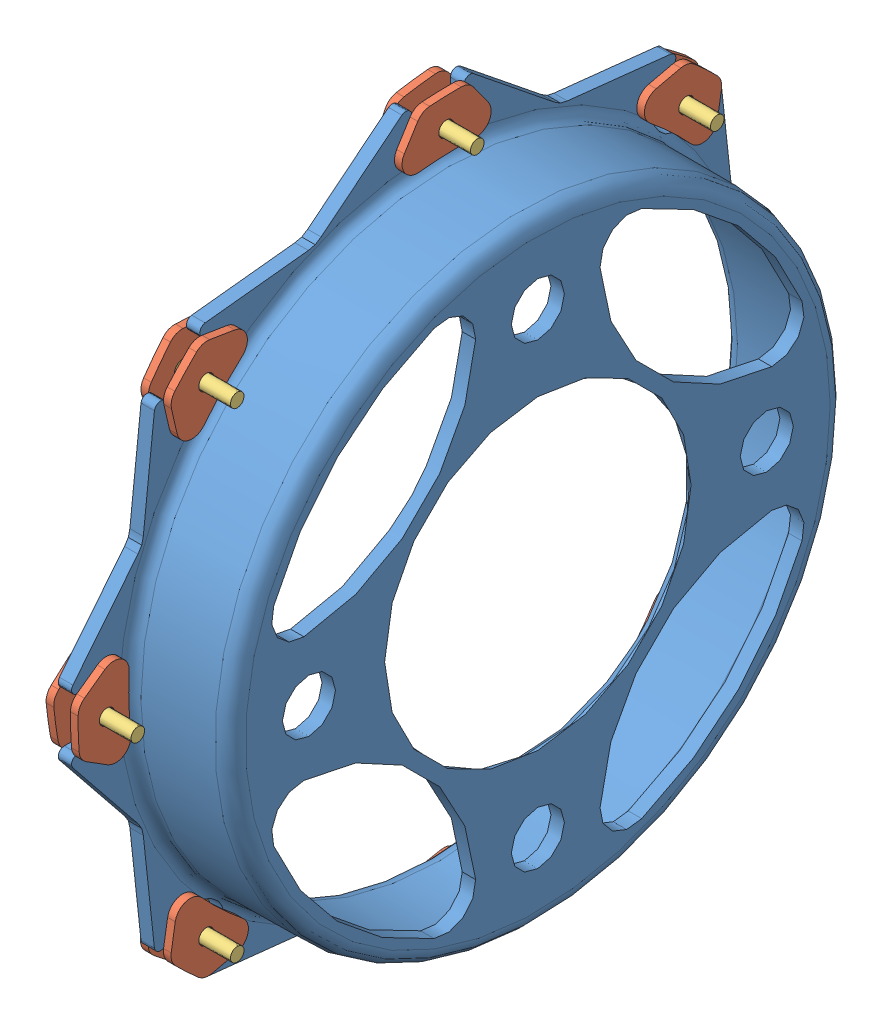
SolidWorks assembly Brake Rotor Assembly.SLDASM, configuration Default (file format 4400). Lengths in mm.
Overall size (25.4 327.78 327.78).
26 component instances, 4 part files, 10 mates.
Components (placement in the parent):
- Rotor Hat-1: Rotor Hat.SLDPRT [Default] at (-34.2242 30.4071 -2.5985) size (23.6 152.4 152.4)
- Rotor-1: Rotor.SLDPRT [Default] at (-31.2397 30.4071 -2.5985) x (0 0.707107 0.707107) z (-1 0 0) size (231.78 231.78 3.17)
- Rotor Washer-1: Rotor Washer.SLDPRT [Default] at (-31.2397 33.0101 -12.653) x (0 0.99948 0.032253) z (1 0 0) size (18.57 10.78 1.59)
- Rotor Washer-27: Rotor Washer.SLDPRT [Chamfer] at (-34.4147 41.3596 -11.9484) x (0 -0.990749 -0.135705) z (-1 0 0) size (18.57 10.78 1.59)
- Rotor Pin-6: Rotor Pin.SLDPRT [.5] at (-34.4534 30.4071 68.0135) x (0 0.996402 -0.084747) z (-1 0 0) size (6.36 6.36 12.79)
- Rotor Washer-13: Rotor Washer.SLDPRT [Default] at (-31.2397 25.1381 -11.5488) x (0 0.729545 -0.683933) z (1 0 0) size (18.57 10.78 1.59)
- Rotor Washer-14: Rotor Washer.SLDPRT [Default] at (-31.2397 20.3526 -5.2016) x (0 0.032253 -0.99948) z (1 0 0) size (18.57 10.78 1.59)
- Rotor Washer-15: Rotor Washer.SLDPRT [Default] at (-31.2397 21.4568 2.6705) x (0 -0.683933 -0.729545) z (1 0 0) size (18.57 10.78 1.59)
- Rotor Washer-16: Rotor Washer.SLDPRT [Default] at (-31.2397 27.804 7.456) x (0 -0.99948 -0.032253) z (1 0 0) size (18.57 10.78 1.59)
- Rotor Washer-17: Rotor Washer.SLDPRT [Default] at (-31.2397 35.676 6.3518) x (0 -0.729545 0.683933) z (1 0 0) size (18.57 10.78 1.59)
- Rotor Pin-7: Rotor Pin.SLDPRT [.5] at (-34.4534 80.3373 47.3317) x (0 0.644638 -0.764488) z (-1 0 0) size (6.36 6.36 12.79)
- Rotor Pin-8: Rotor Pin.SLDPRT [.5] at (-34.4534 101.0191 -2.5985) x (0 -0.084747 -0.996402) z (-1 0 0) size (6.36 6.36 12.79)
- Rotor Pin-9: Rotor Pin.SLDPRT [.5] at (-34.4534 80.3373 -52.5287) x (0 -0.764488 -0.644638) z (-1 0 0) size (6.36 6.36 12.79)
- Rotor Pin-10: Rotor Pin.SLDPRT [.5] at (-34.4534 30.4071 -73.2105) x (0 -0.996402 0.084747) z (-1 0 0) size (6.36 6.36 12.79)
- Rotor Pin-11: Rotor Pin.SLDPRT [.5] at (-34.4534 -19.5231 -52.5287) x (0 -0.644638 0.764488) z (-1 0 0) size (6.36 6.36 12.79)
- Rotor Pin-12: Rotor Pin.SLDPRT [.5] at (-34.4534 -40.2049 -2.5985) x (0 0.084747 0.996402) z (-1 0 0) size (6.36 6.36 12.79)
- Rotor Pin-13: Rotor Pin.SLDPRT [.5] at (-34.4534 -19.5231 47.3317) x (0 0.764488 0.644638) z (-1 0 0) size (6.36 6.36 12.79)
- Rotor Washer-25: Rotor Washer.SLDPRT [Default] at (-31.2397 40.4616 0.0046) x (0 -0.032253 0.99948) z (1 0 0) size (18.57 10.78 1.59)
- Rotor Washer-26: Rotor Washer.SLDPRT [Default] at (-31.2397 39.3573 -7.8675) x (0 0.683933 0.729545) z (1 0 0) size (18.57 10.78 1.59)
- Rotor Washer-28: Rotor Washer.SLDPRT [Chamfer] at (-34.4147 31.5403 -16.9545) x (0 -0.796524 0.604608) z (-1 0 0) size (18.57 10.78 1.59)
- Rotor Washer-29: Rotor Washer.SLDPRT [Chamfer] at (-34.4147 21.0572 -13.551) x (0 -0.135705 0.990749) z (-1 0 0) size (18.57 10.78 1.59)
- Rotor Washer-30: Rotor Washer.SLDPRT [Chamfer] at (-34.4147 16.0511 -3.7317) x (0 0.604608 0.796524) z (-1 0 0) size (18.57 10.78 1.59)
- Rotor Washer-31: Rotor Washer.SLDPRT [Chamfer] at (-34.4147 19.4545 6.7514) x (0 0.990749 0.135705) z (-1 0 0) size (18.57 10.78 1.59)
- Rotor Washer-32: Rotor Washer.SLDPRT [Chamfer] at (-34.4147 29.2738 11.7575) x (0 0.796524 -0.604608) z (-1 0 0) size (18.57 10.78 1.59)
- Rotor Washer-33: Rotor Washer.SLDPRT [Chamfer] at (-34.4147 39.757 8.3541) x (0 0.135705 -0.990749) z (-1 0 0) size (18.57 10.78 1.59)
- Rotor Washer-34: Rotor Washer.SLDPRT [Chamfer] at (-34.4147 44.7631 -1.4652) x (0 -0.604608 -0.796524) z (-1 0 0) size (18.57 10.78 1.59)
Mates (geometry in assembly coordinates):
- Coincident1: coincident anti-aligned: plane of Rotor-1 through (-31.2387 -46.001 2.799) normal (0 0 1); plane of Rotor Hat-1 through (-10.6199 -44.5229 2.799) normal (0 0 -1)
- Distance1: distance = 0.1905 mm aligned: plane of Rotor Hat-1 through (-34.2242 95.5581 -2.5985) normal (-1 0 0); plane of Rotor-1 through (-34.4147 -149.9716 177.7802) normal (-1 0 0)
- Distance2: distance = 0.1905 mm aligned: plane of Rotor Hat-1 through (-34.2242 95.5581 -2.5985) normal (-1 0 0); plane of Rotor-1 through (-34.4147 -149.9716 177.7802) normal (-1 0 0)
- Coincident3: coincident anti-aligned: plane of Rotor-1 through (-31.2397 -149.9716 177.7802) normal (1 0 0); plane of Rotor Washer-1 through (-31.2397 33.4923 70.8481) normal (-1 0 0)
- Concentric4: concentric aligned: cylinder of Rotor Washer-1 through (-29.6522 30.4071 68.0135) axis (-1 0 0) radius 1.5875; cylinder of Rotor-1 through (-31.2387 30.4071 68.0135) axis (-1 0 0) radius 1.5875
- Coincident5: coincident anti-aligned: plane of Rotor-1 through (-34.4147 -149.9716 177.7802) normal (-1 0 0); plane of Rotor Washer-27 through (-34.4147 26.8905 70.291) normal (1 0 0)
- Concentric9: concentric anti-aligned: cylinder of Rotor Pin-6 through (-34.4534 30.4071 68.0135) axis (1 0 0) radius 1.4224; cylinder of Rotor-1 through (-31.2387 30.4071 68.0135) axis (-1 0 0) radius 1.5875
- Coincident6: coincident aligned: cone of Rotor Washer-27 through (-34.0299 30.4071 68.0135) axis (1 0 0); cone of Rotor Pin-6 through (-35.9291 30.4071 68.0135) axis (1 0 0)
- Concentric12: concentric aligned: cylinder of Rotor-1 through (-34.4147 30.4071 -2.5985) axis (1 0 0) radius 115.8875; circle of Rotor Hat-1
- Concentric13: concentric aligned: cylinder of Rotor-1 through (-34.4147 30.4071 -2.5985) axis (1 0 0) radius 115.8875; cylinder of Rotor Hat-1 through (-8.3543 30.4071 -2.5985) axis (1 0 0) radius 64.008
